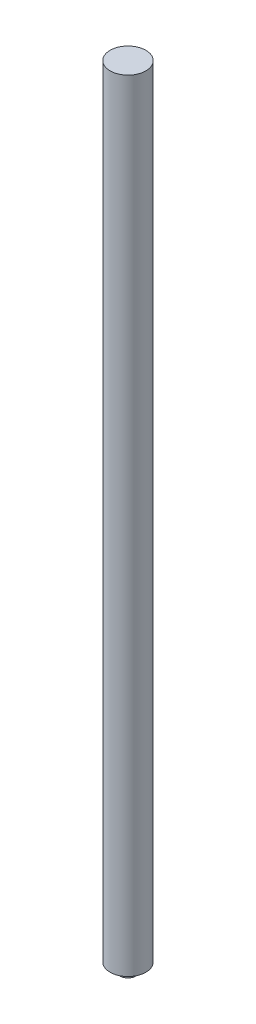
ISO-10303-21;
HEADER;
FILE_DESCRIPTION(('STEP AP214'),'2;1');
FILE_NAME('part.step','',(''),(''),'','','');
FILE_SCHEMA(('AUTOMOTIVE_DESIGN { 1 0 10303 214 1 1 1 1 }'));
ENDSEC;
DATA;
#1=APPLICATION_CONTEXT('core data for automotive mechanical design processes');
#2=APPLICATION_PROTOCOL_DEFINITION('international standard','automotive_design',2000,#1);
#3=PRODUCT_CONTEXT('',#1,'mechanical');
#4=PRODUCT('Part','Part','',(#3));
#5=PRODUCT_RELATED_PRODUCT_CATEGORY('part','',(#4));
#6=PRODUCT_DEFINITION_FORMATION('','',#4);
#7=PRODUCT_DEFINITION_CONTEXT('part definition',#1,'design');
#8=PRODUCT_DEFINITION('design','',#6,#7);
#9=PRODUCT_DEFINITION_SHAPE('','',#8);
#10=(LENGTH_UNIT() NAMED_UNIT(*) SI_UNIT(.MILLI.,.METRE.));
#11=(NAMED_UNIT(*) PLANE_ANGLE_UNIT() SI_UNIT($,.RADIAN.));
#12=(NAMED_UNIT(*) SI_UNIT($,.STERADIAN.) SOLID_ANGLE_UNIT());
#13=UNCERTAINTY_MEASURE_WITH_UNIT(LENGTH_MEASURE(1.E-05),#10,'distance_accuracy_value','');
#14=(GEOMETRIC_REPRESENTATION_CONTEXT(3) GLOBAL_UNCERTAINTY_ASSIGNED_CONTEXT((#13)) GLOBAL_UNIT_ASSIGNED_CONTEXT((#10,
#11,#12)) REPRESENTATION_CONTEXT('',''));
#15=CARTESIAN_POINT('',(0.,0.,0.));
#16=DIRECTION('',(0.,0.,1.));
#17=DIRECTION('',(1.,0.,0.));
#18=AXIS2_PLACEMENT_3D('',#15,#16,#17);
#19=CARTESIAN_POINT('',(11.,486.,0.));
#20=DIRECTION('',(0.,-1.,0.));
#21=DIRECTION('',(1.,0.,0.));
#22=AXIS2_PLACEMENT_3D('',#19,#20,#21);
#23=PLANE('',#22);
#24=CARTESIAN_POINT('',(0.,486.,0.));
#25=DIRECTION('',(0.,1.,0.));
#26=DIRECTION('',(-1.,0.,0.));
#27=AXIS2_PLACEMENT_3D('',#24,#25,#26);
#28=CIRCLE('',#27,11.0000000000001);
#29=CARTESIAN_POINT('',(-11.0000000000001,486.,0.));
#30=VERTEX_POINT('',#29);
#31=EDGE_CURVE('E45',#30,#30,#28,.T.);
#32=ORIENTED_EDGE('',*,*,#31,.T.);
#33=EDGE_LOOP('',(#32));
#34=FACE_BOUND('',#33,.T.);
#35=ADVANCED_FACE('F31',(#34),#23,.F.);
#36=CARTESIAN_POINT('',(0.,0.,0.));
#37=DIRECTION('',(0.,1.,0.));
#38=DIRECTION('',(-1.,0.,0.));
#39=AXIS2_PLACEMENT_3D('',#36,#37,#38);
#40=PLANE('',#39);
#41=CARTESIAN_POINT('',(0.,0.,0.));
#42=DIRECTION('',(0.,1.,0.));
#43=DIRECTION('',(-1.,0.,0.));
#44=AXIS2_PLACEMENT_3D('',#41,#42,#43);
#45=CIRCLE('',#44,5.00000000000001);
#46=CARTESIAN_POINT('',(-5.00000000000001,0.,0.));
#47=VERTEX_POINT('',#46);
#48=EDGE_CURVE('E10',#47,#47,#45,.T.);
#49=ORIENTED_EDGE('',*,*,#48,.F.);
#50=EDGE_LOOP('',(#49));
#51=FACE_BOUND('',#50,.T.);
#52=ADVANCED_FACE('F65',(#51),#40,.F.);
#53=CARTESIAN_POINT('',(0.,486.,0.));
#54=DIRECTION('',(0.,1.,0.));
#55=DIRECTION('',(-1.,0.,0.));
#56=AXIS2_PLACEMENT_3D('',#53,#54,#55);
#57=CYLINDRICAL_SURFACE('',#56,5.00000000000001);
#58=CARTESIAN_POINT('',(0.,5.,0.));
#59=DIRECTION('',(0.,1.,0.));
#60=DIRECTION('',(-1.,0.,0.));
#61=AXIS2_PLACEMENT_3D('',#58,#59,#60);
#62=CIRCLE('',#61,5.00000000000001);
#63=CARTESIAN_POINT('',(-5.00000000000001,5.,0.));
#64=VERTEX_POINT('',#63);
#65=EDGE_CURVE('E37',#64,#64,#62,.T.);
#66=ORIENTED_EDGE('',*,*,#65,.F.);
#67=EDGE_LOOP('',(#66));
#68=FACE_BOUND('',#67,.T.);
#69=ORIENTED_EDGE('',*,*,#48,.T.);
#70=EDGE_LOOP('',(#69));
#71=FACE_BOUND('',#70,.T.);
#72=ADVANCED_FACE('F60',(#68,#71),#57,.T.);
#73=CARTESIAN_POINT('',(5.00000000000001,5.,0.));
#74=DIRECTION('',(0.,1.,0.));
#75=DIRECTION('',(-1.,0.,0.));
#76=AXIS2_PLACEMENT_3D('',#73,#74,#75);
#77=PLANE('',#76);
#78=CARTESIAN_POINT('',(0.,5.,0.));
#79=DIRECTION('',(0.,1.,0.));
#80=DIRECTION('',(-1.,0.,0.));
#81=AXIS2_PLACEMENT_3D('',#78,#79,#80);
#82=CIRCLE('',#81,11.);
#83=CARTESIAN_POINT('',(-11.,5.,0.));
#84=VERTEX_POINT('',#83);
#85=EDGE_CURVE('E41',#84,#84,#82,.T.);
#86=ORIENTED_EDGE('',*,*,#85,.F.);
#87=EDGE_LOOP('',(#86));
#88=FACE_BOUND('',#87,.T.);
#89=ORIENTED_EDGE('',*,*,#65,.T.);
#90=EDGE_LOOP('',(#89));
#91=FACE_BOUND('',#90,.T.);
#92=ADVANCED_FACE('F55',(#88,#91),#77,.F.);
#93=CARTESIAN_POINT('',(0.,486.,0.));
#94=DIRECTION('',(0.,1.,0.));
#95=DIRECTION('',(-1.,0.,0.));
#96=AXIS2_PLACEMENT_3D('',#93,#94,#95);
#97=CYLINDRICAL_SURFACE('',#96,11.);
#98=ORIENTED_EDGE('',*,*,#31,.F.);
#99=EDGE_LOOP('',(#98));
#100=FACE_BOUND('',#99,.T.);
#101=ORIENTED_EDGE('',*,*,#85,.T.);
#102=EDGE_LOOP('',(#101));
#103=FACE_BOUND('',#102,.T.);
#104=ADVANCED_FACE('F52',(#100,#103),#97,.T.);
#105=CLOSED_SHELL('',(#35,#52,#72,#92,#104));
#106=MANIFOLD_SOLID_BREP('B2',#105);
#107=ADVANCED_BREP_SHAPE_REPRESENTATION('',(#18,#106),#14);
#108=SHAPE_DEFINITION_REPRESENTATION(#9,#107);
ENDSEC;
END-ISO-10303-21;
